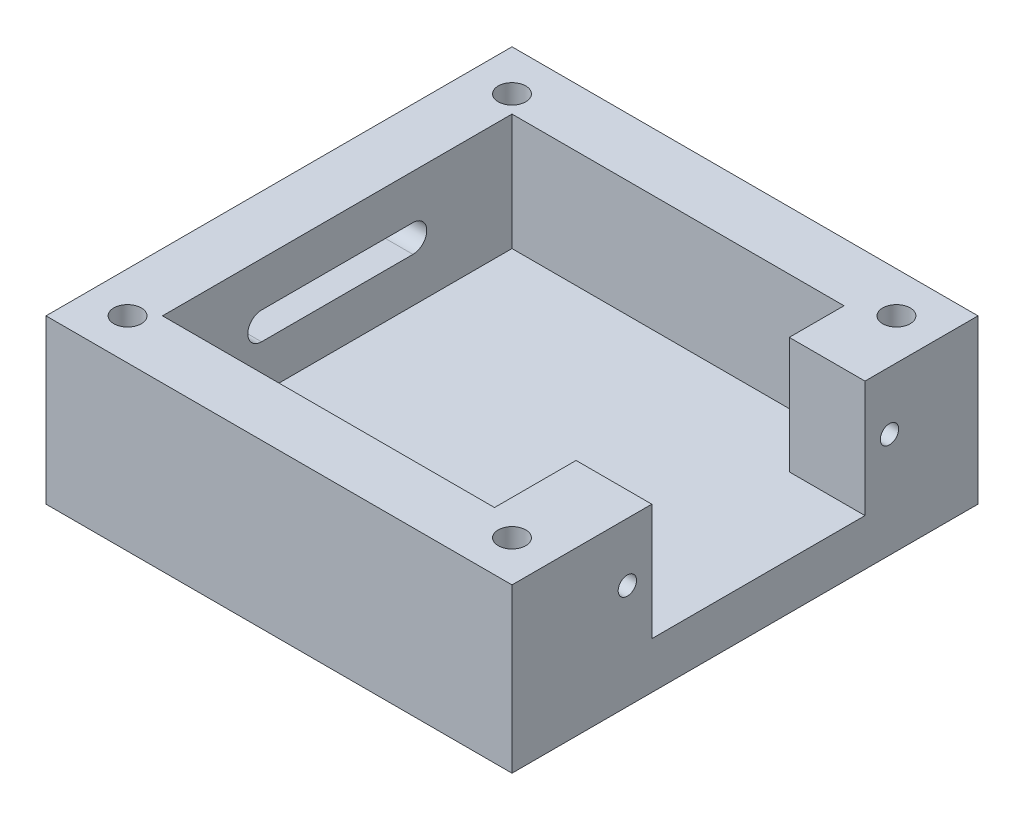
ISO-10303-21;
HEADER;
FILE_DESCRIPTION(('STEP AP214'),'2;1');
FILE_NAME('part.step','',(''),(''),'','','');
FILE_SCHEMA(('AUTOMOTIVE_DESIGN { 1 0 10303 214 1 1 1 1 }'));
ENDSEC;
DATA;
#1=APPLICATION_CONTEXT('core data for automotive mechanical design processes');
#2=APPLICATION_PROTOCOL_DEFINITION('international standard','automotive_design',2000,#1);
#3=PRODUCT_CONTEXT('',#1,'mechanical');
#4=PRODUCT('Part','Part','',(#3));
#5=PRODUCT_RELATED_PRODUCT_CATEGORY('part','',(#4));
#6=PRODUCT_DEFINITION_FORMATION('','',#4);
#7=PRODUCT_DEFINITION_CONTEXT('part definition',#1,'design');
#8=PRODUCT_DEFINITION('design','',#6,#7);
#9=PRODUCT_DEFINITION_SHAPE('','',#8);
#10=(LENGTH_UNIT() NAMED_UNIT(*) SI_UNIT(.MILLI.,.METRE.));
#11=(NAMED_UNIT(*) PLANE_ANGLE_UNIT() SI_UNIT($,.RADIAN.));
#12=(NAMED_UNIT(*) SI_UNIT($,.STERADIAN.) SOLID_ANGLE_UNIT());
#13=UNCERTAINTY_MEASURE_WITH_UNIT(LENGTH_MEASURE(1.E-05),#10,'distance_accuracy_value','');
#14=(GEOMETRIC_REPRESENTATION_CONTEXT(3) GLOBAL_UNCERTAINTY_ASSIGNED_CONTEXT((#13)) GLOBAL_UNIT_ASSIGNED_CONTEXT((#10,
#11,#12)) REPRESENTATION_CONTEXT('',''));
#15=CARTESIAN_POINT('',(0.,0.,0.));
#16=DIRECTION('',(0.,0.,1.));
#17=DIRECTION('',(1.,0.,0.));
#18=AXIS2_PLACEMENT_3D('',#15,#16,#17);
#19=CARTESIAN_POINT('',(0.,5.08,0.));
#20=DIRECTION('',(0.,-1.,0.));
#21=DIRECTION('',(0.,0.,-1.));
#22=AXIS2_PLACEMENT_3D('',#19,#20,#21);
#23=PLANE('',#22);
#24=DIRECTION('',(1.,0.,0.));
#25=VECTOR('',#24,1.);
#26=CARTESIAN_POINT('',(17.145,5.08,-13.081));
#27=LINE('',#26,#25);
#28=CARTESIAN_POINT('',(17.145,5.08,-13.081));
#29=VERTEX_POINT('',#28);
#30=CARTESIAN_POINT('',(25.4,5.08,-13.081));
#31=VERTEX_POINT('',#30);
#32=EDGE_CURVE('E261',#29,#31,#27,.T.);
#33=ORIENTED_EDGE('',*,*,#32,.F.);
#34=DIRECTION('',(0.,0.,1.));
#35=VECTOR('',#34,1.);
#36=CARTESIAN_POINT('',(17.145,5.08,-19.05));
#37=LINE('',#36,#35);
#38=CARTESIAN_POINT('',(17.145,5.08,-19.05));
#39=VERTEX_POINT('',#38);
#40=EDGE_CURVE('E301',#39,#29,#37,.T.);
#41=ORIENTED_EDGE('',*,*,#40,.F.);
#42=DIRECTION('',(1.,0.,0.));
#43=VECTOR('',#42,1.);
#44=CARTESIAN_POINT('',(17.145,5.08,-19.05));
#45=LINE('',#44,#43);
#46=CARTESIAN_POINT('',(-19.05,5.08,-19.05));
#47=VERTEX_POINT('',#46);
#48=EDGE_CURVE('E298',#47,#39,#45,.T.);
#49=ORIENTED_EDGE('',*,*,#48,.F.);
#50=DIRECTION('',(0.,0.,-1.));
#51=VECTOR('',#50,1.);
#52=CARTESIAN_POINT('',(-19.05,5.08,-19.05));
#53=LINE('',#52,#51);
#54=CARTESIAN_POINT('',(-19.05,5.08,19.05));
#55=VERTEX_POINT('',#54);
#56=EDGE_CURVE('E295',#55,#47,#53,.T.);
#57=ORIENTED_EDGE('',*,*,#56,.F.);
#58=DIRECTION('',(-1.,0.,0.));
#59=VECTOR('',#58,1.);
#60=CARTESIAN_POINT('',(-19.05,5.08,19.05));
#61=LINE('',#60,#59);
#62=CARTESIAN_POINT('',(17.145,5.08,19.05));
#63=VERTEX_POINT('',#62);
#64=EDGE_CURVE('E292',#63,#55,#61,.T.);
#65=ORIENTED_EDGE('',*,*,#64,.F.);
#66=DIRECTION('',(0.,0.,1.));
#67=VECTOR('',#66,1.);
#68=CARTESIAN_POINT('',(17.145,5.08,19.05));
#69=LINE('',#68,#67);
#70=CARTESIAN_POINT('',(17.145,5.08,10.16));
#71=VERTEX_POINT('',#70);
#72=EDGE_CURVE('E289',#71,#63,#69,.T.);
#73=ORIENTED_EDGE('',*,*,#72,.F.);
#74=DIRECTION('',(-1.,0.,0.));
#75=VECTOR('',#74,1.);
#76=CARTESIAN_POINT('',(17.145,5.08,10.16));
#77=LINE('',#76,#75);
#78=CARTESIAN_POINT('',(25.4,5.08,10.16));
#79=VERTEX_POINT('',#78);
#80=EDGE_CURVE('E248',#79,#71,#77,.T.);
#81=ORIENTED_EDGE('',*,*,#80,.F.);
#82=DIRECTION('',(0.,0.,-1.));
#83=VECTOR('',#82,1.);
#84=CARTESIAN_POINT('',(25.4,5.08,25.4));
#85=LINE('',#84,#83);
#86=EDGE_CURVE('E330',#79,#31,#85,.T.);
#87=ORIENTED_EDGE('',*,*,#86,.T.);
#88=EDGE_LOOP('',(#33,#41,#49,#57,#65,#73,#81,#87));
#89=FACE_BOUND('',#88,.T.);
#90=ADVANCED_FACE('F41',(#89),#23,.F.);
#91=CARTESIAN_POINT('',(25.4,5.08,25.4));
#92=DIRECTION('',(-1.,0.,0.));
#93=DIRECTION('',(0.,0.,1.));
#94=AXIS2_PLACEMENT_3D('',#91,#92,#93);
#95=PLANE('',#94);
#96=CARTESIAN_POINT('',(25.4,11.43,12.827));
#97=DIRECTION('',(-1.,0.,0.));
#98=DIRECTION('',(0.,0.,1.));
#99=AXIS2_PLACEMENT_3D('',#96,#97,#98);
#100=CIRCLE('',#99,0.999999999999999);
#101=CARTESIAN_POINT('',(25.4,11.43,13.827));
#102=VERTEX_POINT('',#101);
#103=EDGE_CURVE('E245',#102,#102,#100,.T.);
#104=ORIENTED_EDGE('',*,*,#103,.T.);
#105=EDGE_LOOP('',(#104));
#106=FACE_BOUND('',#105,.T.);
#107=CARTESIAN_POINT('',(25.4,11.43,-15.748));
#108=DIRECTION('',(-1.,0.,0.));
#109=DIRECTION('',(0.,0.,1.));
#110=AXIS2_PLACEMENT_3D('',#107,#108,#109);
#111=CIRCLE('',#110,1.);
#112=CARTESIAN_POINT('',(25.4,11.43,-14.748));
#113=VERTEX_POINT('',#112);
#114=EDGE_CURVE('E252',#113,#113,#111,.T.);
#115=ORIENTED_EDGE('',*,*,#114,.T.);
#116=EDGE_LOOP('',(#115));
#117=FACE_BOUND('',#116,.T.);
#118=DIRECTION('',(0.,0.,-1.));
#119=VECTOR('',#118,1.);
#120=CARTESIAN_POINT('',(25.4,0.,25.4));
#121=LINE('',#120,#119);
#122=CARTESIAN_POINT('',(25.4,0.,25.4));
#123=VERTEX_POINT('',#122);
#124=CARTESIAN_POINT('',(25.4,0.,-25.4));
#125=VERTEX_POINT('',#124);
#126=EDGE_CURVE('E329',#123,#125,#121,.T.);
#127=ORIENTED_EDGE('',*,*,#126,.T.);
#128=DIRECTION('',(0.,-1.,0.));
#129=VECTOR('',#128,1.);
#130=CARTESIAN_POINT('',(25.4,5.08,-25.4));
#131=LINE('',#130,#129);
#132=CARTESIAN_POINT('',(25.4,17.78,-25.4));
#133=VERTEX_POINT('',#132);
#134=EDGE_CURVE('E11',#133,#125,#131,.T.);
#135=ORIENTED_EDGE('',*,*,#134,.F.);
#136=DIRECTION('',(0.,0.,-1.));
#137=VECTOR('',#136,1.);
#138=CARTESIAN_POINT('',(25.4,17.78,-13.081));
#139=LINE('',#138,#137);
#140=CARTESIAN_POINT('',(25.4,17.78,-13.081));
#141=VERTEX_POINT('',#140);
#142=EDGE_CURVE('E280',#141,#133,#139,.T.);
#143=ORIENTED_EDGE('',*,*,#142,.F.);
#144=DIRECTION('',(0.,-1.,0.));
#145=VECTOR('',#144,1.);
#146=CARTESIAN_POINT('',(25.4,17.78,-13.081));
#147=LINE('',#146,#145);
#148=EDGE_CURVE('E286',#141,#31,#147,.T.);
#149=ORIENTED_EDGE('',*,*,#148,.T.);
#150=ORIENTED_EDGE('',*,*,#86,.F.);
#151=DIRECTION('',(0.,-1.,0.));
#152=VECTOR('',#151,1.);
#153=CARTESIAN_POINT('',(25.4,17.78,10.16));
#154=LINE('',#153,#152);
#155=CARTESIAN_POINT('',(25.4,17.78,10.16));
#156=VERTEX_POINT('',#155);
#157=EDGE_CURVE('E326',#156,#79,#154,.T.);
#158=ORIENTED_EDGE('',*,*,#157,.F.);
#159=DIRECTION('',(0.,0.,-1.));
#160=VECTOR('',#159,1.);
#161=CARTESIAN_POINT('',(25.4,17.78,25.4));
#162=LINE('',#161,#160);
#163=CARTESIAN_POINT('',(25.4,17.78,25.4));
#164=VERTEX_POINT('',#163);
#165=EDGE_CURVE('E264',#164,#156,#162,.T.);
#166=ORIENTED_EDGE('',*,*,#165,.F.);
#167=DIRECTION('',(0.,-1.,0.));
#168=VECTOR('',#167,1.);
#169=CARTESIAN_POINT('',(25.4,5.08,25.4));
#170=LINE('',#169,#168);
#171=EDGE_CURVE('E332',#164,#123,#170,.T.);
#172=ORIENTED_EDGE('',*,*,#171,.T.);
#173=EDGE_LOOP('',(#127,#135,#143,#149,#150,#158,#166,#172));
#174=FACE_BOUND('',#173,.T.);
#175=ADVANCED_FACE('F43',(#106,#117,#174),#95,.F.);
#176=CARTESIAN_POINT('',(-25.4,5.08,-25.4));
#177=DIRECTION('',(0.,0.,1.));
#178=DIRECTION('',(1.,0.,0.));
#179=AXIS2_PLACEMENT_3D('',#176,#177,#178);
#180=PLANE('',#179);
#181=DIRECTION('',(-1.,0.,0.));
#182=VECTOR('',#181,1.);
#183=CARTESIAN_POINT('',(-25.4,0.,-25.4));
#184=LINE('',#183,#182);
#185=CARTESIAN_POINT('',(-25.4,0.,-25.4));
#186=VERTEX_POINT('',#185);
#187=EDGE_CURVE('E336',#125,#186,#184,.T.);
#188=ORIENTED_EDGE('',*,*,#187,.T.);
#189=DIRECTION('',(0.,-1.,0.));
#190=VECTOR('',#189,1.);
#191=CARTESIAN_POINT('',(-25.4,5.08,-25.4));
#192=LINE('',#191,#190);
#193=CARTESIAN_POINT('',(-25.4,17.78,-25.4));
#194=VERTEX_POINT('',#193);
#195=EDGE_CURVE('E49',#194,#186,#192,.T.);
#196=ORIENTED_EDGE('',*,*,#195,.F.);
#197=DIRECTION('',(-1.,0.,0.));
#198=VECTOR('',#197,1.);
#199=CARTESIAN_POINT('',(25.4,17.78,-25.4));
#200=LINE('',#199,#198);
#201=EDGE_CURVE('E283',#133,#194,#200,.T.);
#202=ORIENTED_EDGE('',*,*,#201,.F.);
#203=ORIENTED_EDGE('',*,*,#134,.T.);
#204=EDGE_LOOP('',(#188,#196,#202,#203));
#205=FACE_BOUND('',#204,.T.);
#206=ADVANCED_FACE('F368',(#205),#180,.F.);
#207=CARTESIAN_POINT('',(-25.4,5.08,25.4));
#208=DIRECTION('',(1.,0.,0.));
#209=DIRECTION('',(0.,0.,-1.));
#210=AXIS2_PLACEMENT_3D('',#207,#208,#209);
#211=PLANE('',#210);
#212=DIRECTION('',(0.,0.,-1.));
#213=VECTOR('',#212,1.);
#214=CARTESIAN_POINT('',(-25.4,12.93,8.255));
#215=LINE('',#214,#213);
#216=CARTESIAN_POINT('',(-25.4,12.93,8.255));
#217=VERTEX_POINT('',#216);
#218=CARTESIAN_POINT('',(-25.4,12.93,-8.255));
#219=VERTEX_POINT('',#218);
#220=EDGE_CURVE('E176',#217,#219,#215,.T.);
#221=ORIENTED_EDGE('',*,*,#220,.F.);
#222=CARTESIAN_POINT('',(-25.4,11.43,8.255));
#223=DIRECTION('',(-1.,0.,0.));
#224=DIRECTION('',(0.,0.,1.));
#225=AXIS2_PLACEMENT_3D('',#222,#223,#224);
#226=CIRCLE('',#225,1.5);
#227=CARTESIAN_POINT('',(-25.4,9.93,8.255));
#228=VERTEX_POINT('',#227);
#229=EDGE_CURVE('E56',#228,#217,#226,.T.);
#230=ORIENTED_EDGE('',*,*,#229,.F.);
#231=DIRECTION('',(0.,0.,1.));
#232=VECTOR('',#231,1.);
#233=CARTESIAN_POINT('',(-25.4,9.93,8.255));
#234=LINE('',#233,#232);
#235=CARTESIAN_POINT('',(-25.4,9.93,-8.255));
#236=VERTEX_POINT('',#235);
#237=EDGE_CURVE('E162',#236,#228,#234,.T.);
#238=ORIENTED_EDGE('',*,*,#237,.F.);
#239=CARTESIAN_POINT('',(-25.4,11.43,-8.255));
#240=DIRECTION('',(-1.,0.,0.));
#241=DIRECTION('',(0.,0.,1.));
#242=AXIS2_PLACEMENT_3D('',#239,#240,#241);
#243=CIRCLE('',#242,1.5);
#244=EDGE_CURVE('E182',#219,#236,#243,.T.);
#245=ORIENTED_EDGE('',*,*,#244,.F.);
#246=EDGE_LOOP('',(#221,#230,#238,#245));
#247=FACE_BOUND('',#246,.T.);
#248=DIRECTION('',(0.,0.,1.));
#249=VECTOR('',#248,1.);
#250=CARTESIAN_POINT('',(-25.4,0.,25.4));
#251=LINE('',#250,#249);
#252=CARTESIAN_POINT('',(-25.4,0.,25.4));
#253=VERTEX_POINT('',#252);
#254=EDGE_CURVE('E338',#186,#253,#251,.T.);
#255=ORIENTED_EDGE('',*,*,#254,.T.);
#256=DIRECTION('',(0.,-1.,0.));
#257=VECTOR('',#256,1.);
#258=CARTESIAN_POINT('',(-25.4,5.08,25.4));
#259=LINE('',#258,#257);
#260=CARTESIAN_POINT('',(-25.4,17.78,25.4));
#261=VERTEX_POINT('',#260);
#262=EDGE_CURVE('E343',#261,#253,#259,.T.);
#263=ORIENTED_EDGE('',*,*,#262,.F.);
#264=DIRECTION('',(0.,0.,1.));
#265=VECTOR('',#264,1.);
#266=CARTESIAN_POINT('',(-25.4,17.78,-25.4));
#267=LINE('',#266,#265);
#268=EDGE_CURVE('E257',#194,#261,#267,.T.);
#269=ORIENTED_EDGE('',*,*,#268,.F.);
#270=ORIENTED_EDGE('',*,*,#195,.T.);
#271=EDGE_LOOP('',(#255,#263,#269,#270));
#272=FACE_BOUND('',#271,.T.);
#273=ADVANCED_FACE('F349',(#247,#272),#211,.F.);
#274=CARTESIAN_POINT('',(-25.4,5.08,25.4));
#275=DIRECTION('',(0.,0.,-1.));
#276=DIRECTION('',(-1.,0.,0.));
#277=AXIS2_PLACEMENT_3D('',#274,#275,#276);
#278=PLANE('',#277);
#279=DIRECTION('',(1.,0.,0.));
#280=VECTOR('',#279,1.);
#281=CARTESIAN_POINT('',(-25.4,0.,25.4));
#282=LINE('',#281,#280);
#283=EDGE_CURVE('E333',#253,#123,#282,.T.);
#284=ORIENTED_EDGE('',*,*,#283,.T.);
#285=ORIENTED_EDGE('',*,*,#171,.F.);
#286=DIRECTION('',(1.,0.,0.));
#287=VECTOR('',#286,1.);
#288=CARTESIAN_POINT('',(-25.4,17.78,25.4));
#289=LINE('',#288,#287);
#290=EDGE_CURVE('E260',#261,#164,#289,.T.);
#291=ORIENTED_EDGE('',*,*,#290,.F.);
#292=ORIENTED_EDGE('',*,*,#262,.T.);
#293=EDGE_LOOP('',(#284,#285,#291,#292));
#294=FACE_BOUND('',#293,.T.);
#295=ADVANCED_FACE('F357',(#294),#278,.F.);
#296=CARTESIAN_POINT('',(0.,0.,0.));
#297=DIRECTION('',(0.,-1.,0.));
#298=DIRECTION('',(0.,0.,-1.));
#299=AXIS2_PLACEMENT_3D('',#296,#297,#298);
#300=PLANE('',#299);
#301=CARTESIAN_POINT('',(0.,0.,0.));
#302=DIRECTION('',(0.,-1.,0.));
#303=DIRECTION('',(0.,0.,-1.));
#304=AXIS2_PLACEMENT_3D('',#301,#302,#303);
#305=CIRCLE('',#304,4.064);
#306=CARTESIAN_POINT('',(0.,0.,-4.064));
#307=VERTEX_POINT('',#306);
#308=EDGE_CURVE('E168',#307,#307,#305,.T.);
#309=ORIENTED_EDGE('',*,*,#308,.F.);
#310=EDGE_LOOP('',(#309));
#311=FACE_BOUND('',#310,.T.);
#312=CARTESIAN_POINT('',(20.955,0.,20.955));
#313=DIRECTION('',(0.,-1.,0.));
#314=DIRECTION('',(0.,0.,-1.));
#315=AXIS2_PLACEMENT_3D('',#312,#313,#314);
#316=CIRCLE('',#315,2.921);
#317=CARTESIAN_POINT('',(20.955,0.,18.034));
#318=VERTEX_POINT('',#317);
#319=EDGE_CURVE('E218',#318,#318,#316,.T.);
#320=ORIENTED_EDGE('',*,*,#319,.F.);
#321=EDGE_LOOP('',(#320));
#322=FACE_BOUND('',#321,.T.);
#323=CARTESIAN_POINT('',(20.955,0.,-20.955));
#324=DIRECTION('',(0.,-1.,0.));
#325=DIRECTION('',(0.,0.,-1.));
#326=AXIS2_PLACEMENT_3D('',#323,#324,#325);
#327=CIRCLE('',#326,2.921);
#328=CARTESIAN_POINT('',(20.955,0.,-23.876));
#329=VERTEX_POINT('',#328);
#330=EDGE_CURVE('E231',#329,#329,#327,.T.);
#331=ORIENTED_EDGE('',*,*,#330,.F.);
#332=EDGE_LOOP('',(#331));
#333=FACE_BOUND('',#332,.T.);
#334=CARTESIAN_POINT('',(-20.955,0.,-20.955));
#335=DIRECTION('',(0.,-1.,0.));
#336=DIRECTION('',(0.,0.,-1.));
#337=AXIS2_PLACEMENT_3D('',#334,#335,#336);
#338=CIRCLE('',#337,2.921);
#339=CARTESIAN_POINT('',(-20.955,0.,-23.876));
#340=VERTEX_POINT('',#339);
#341=EDGE_CURVE('E225',#340,#340,#338,.T.);
#342=ORIENTED_EDGE('',*,*,#341,.F.);
#343=EDGE_LOOP('',(#342));
#344=FACE_BOUND('',#343,.T.);
#345=CARTESIAN_POINT('',(-20.955,0.,20.955));
#346=DIRECTION('',(0.,-1.,0.));
#347=DIRECTION('',(0.,0.,-1.));
#348=AXIS2_PLACEMENT_3D('',#345,#346,#347);
#349=CIRCLE('',#348,2.921);
#350=CARTESIAN_POINT('',(-20.955,0.,18.034));
#351=VERTEX_POINT('',#350);
#352=EDGE_CURVE('E224',#351,#351,#349,.T.);
#353=ORIENTED_EDGE('',*,*,#352,.F.);
#354=EDGE_LOOP('',(#353));
#355=FACE_BOUND('',#354,.T.);
#356=ORIENTED_EDGE('',*,*,#126,.F.);
#357=ORIENTED_EDGE('',*,*,#283,.F.);
#358=ORIENTED_EDGE('',*,*,#254,.F.);
#359=ORIENTED_EDGE('',*,*,#187,.F.);
#360=EDGE_LOOP('',(#356,#357,#358,#359));
#361=FACE_BOUND('',#360,.T.);
#362=ADVANCED_FACE('F355',(#311,#322,#333,#344,#355,#361),#300,.T.);
#363=CARTESIAN_POINT('',(17.145,17.78,10.16));
#364=DIRECTION('',(0.,0.,1.));
#365=DIRECTION('',(1.,0.,0.));
#366=AXIS2_PLACEMENT_3D('',#363,#364,#365);
#367=PLANE('',#366);
#368=ORIENTED_EDGE('',*,*,#80,.T.);
#369=DIRECTION('',(0.,-1.,0.));
#370=VECTOR('',#369,1.);
#371=CARTESIAN_POINT('',(17.145,17.78,10.16));
#372=LINE('',#371,#370);
#373=CARTESIAN_POINT('',(17.145,17.78,10.16));
#374=VERTEX_POINT('',#373);
#375=EDGE_CURVE('E323',#374,#71,#372,.T.);
#376=ORIENTED_EDGE('',*,*,#375,.F.);
#377=DIRECTION('',(-1.,0.,0.));
#378=VECTOR('',#377,1.);
#379=CARTESIAN_POINT('',(17.145,17.78,10.16));
#380=LINE('',#379,#378);
#381=EDGE_CURVE('E266',#156,#374,#380,.T.);
#382=ORIENTED_EDGE('',*,*,#381,.F.);
#383=ORIENTED_EDGE('',*,*,#157,.T.);
#384=EDGE_LOOP('',(#368,#376,#382,#383));
#385=FACE_BOUND('',#384,.T.);
#386=ADVANCED_FACE('F393',(#385),#367,.F.);
#387=CARTESIAN_POINT('',(17.145,17.78,19.05));
#388=DIRECTION('',(1.,0.,0.));
#389=DIRECTION('',(0.,0.,-1.));
#390=AXIS2_PLACEMENT_3D('',#387,#388,#389);
#391=PLANE('',#390);
#392=CARTESIAN_POINT('',(17.145,11.43,12.827));
#393=DIRECTION('',(-1.,0.,0.));
#394=DIRECTION('',(0.,0.,1.));
#395=AXIS2_PLACEMENT_3D('',#392,#393,#394);
#396=CIRCLE('',#395,0.999999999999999);
#397=CARTESIAN_POINT('',(17.145,11.43,13.827));
#398=VERTEX_POINT('',#397);
#399=EDGE_CURVE('E249',#398,#398,#396,.T.);
#400=ORIENTED_EDGE('',*,*,#399,.F.);
#401=EDGE_LOOP('',(#400));
#402=FACE_BOUND('',#401,.T.);
#403=ORIENTED_EDGE('',*,*,#72,.T.);
#404=DIRECTION('',(0.,-1.,0.));
#405=VECTOR('',#404,1.);
#406=CARTESIAN_POINT('',(17.145,17.78,19.05));
#407=LINE('',#406,#405);
#408=CARTESIAN_POINT('',(17.145,17.78,19.05));
#409=VERTEX_POINT('',#408);
#410=EDGE_CURVE('E320',#409,#63,#407,.T.);
#411=ORIENTED_EDGE('',*,*,#410,.F.);
#412=DIRECTION('',(0.,0.,1.));
#413=VECTOR('',#412,1.);
#414=CARTESIAN_POINT('',(17.145,17.78,19.05));
#415=LINE('',#414,#413);
#416=EDGE_CURVE('E268',#374,#409,#415,.T.);
#417=ORIENTED_EDGE('',*,*,#416,.F.);
#418=ORIENTED_EDGE('',*,*,#375,.T.);
#419=EDGE_LOOP('',(#403,#411,#417,#418));
#420=FACE_BOUND('',#419,.T.);
#421=ADVANCED_FACE('F390',(#402,#420),#391,.F.);
#422=CARTESIAN_POINT('',(-19.05,17.78,19.05));
#423=DIRECTION('',(0.,0.,1.));
#424=DIRECTION('',(1.,0.,0.));
#425=AXIS2_PLACEMENT_3D('',#422,#423,#424);
#426=PLANE('',#425);
#427=ORIENTED_EDGE('',*,*,#64,.T.);
#428=DIRECTION('',(0.,-1.,0.));
#429=VECTOR('',#428,1.);
#430=CARTESIAN_POINT('',(-19.05,17.78,19.05));
#431=LINE('',#430,#429);
#432=CARTESIAN_POINT('',(-19.05,17.78,19.05));
#433=VERTEX_POINT('',#432);
#434=EDGE_CURVE('E317',#433,#55,#431,.T.);
#435=ORIENTED_EDGE('',*,*,#434,.F.);
#436=DIRECTION('',(-1.,0.,0.));
#437=VECTOR('',#436,1.);
#438=CARTESIAN_POINT('',(-19.05,17.78,19.05));
#439=LINE('',#438,#437);
#440=EDGE_CURVE('E270',#409,#433,#439,.T.);
#441=ORIENTED_EDGE('',*,*,#440,.F.);
#442=ORIENTED_EDGE('',*,*,#410,.T.);
#443=EDGE_LOOP('',(#427,#435,#441,#442));
#444=FACE_BOUND('',#443,.T.);
#445=ADVANCED_FACE('F387',(#444),#426,.F.);
#446=CARTESIAN_POINT('',(-19.05,17.78,-19.05));
#447=DIRECTION('',(-1.,0.,0.));
#448=DIRECTION('',(0.,0.,1.));
#449=AXIS2_PLACEMENT_3D('',#446,#447,#448);
#450=PLANE('',#449);
#451=DIRECTION('',(0.,0.,-1.));
#452=VECTOR('',#451,1.);
#453=CARTESIAN_POINT('',(-19.05,9.93,8.255));
#454=LINE('',#453,#452);
#455=CARTESIAN_POINT('',(-19.05,9.93,8.255));
#456=VERTEX_POINT('',#455);
#457=CARTESIAN_POINT('',(-19.05,9.93,-8.255));
#458=VERTEX_POINT('',#457);
#459=EDGE_CURVE('E174',#456,#458,#454,.T.);
#460=ORIENTED_EDGE('',*,*,#459,.F.);
#461=CARTESIAN_POINT('',(-19.05,11.43,8.255));
#462=DIRECTION('',(-1.,0.,0.));
#463=DIRECTION('',(0.,0.,1.));
#464=AXIS2_PLACEMENT_3D('',#461,#462,#463);
#465=CIRCLE('',#464,1.5);
#466=CARTESIAN_POINT('',(-19.05,12.93,8.255));
#467=VERTEX_POINT('',#466);
#468=EDGE_CURVE('E156',#467,#456,#465,.F.);
#469=ORIENTED_EDGE('',*,*,#468,.F.);
#470=DIRECTION('',(0.,0.,1.));
#471=VECTOR('',#470,1.);
#472=CARTESIAN_POINT('',(-19.05,12.93,8.255));
#473=LINE('',#472,#471);
#474=CARTESIAN_POINT('',(-19.05,12.93,-8.255));
#475=VERTEX_POINT('',#474);
#476=EDGE_CURVE('E165',#475,#467,#473,.T.);
#477=ORIENTED_EDGE('',*,*,#476,.F.);
#478=CARTESIAN_POINT('',(-19.05,11.43,-8.255));
#479=DIRECTION('',(-1.,0.,0.));
#480=DIRECTION('',(0.,0.,1.));
#481=AXIS2_PLACEMENT_3D('',#478,#479,#480);
#482=CIRCLE('',#481,1.5);
#483=EDGE_CURVE('E64',#458,#475,#482,.F.);
#484=ORIENTED_EDGE('',*,*,#483,.F.);
#485=EDGE_LOOP('',(#460,#469,#477,#484));
#486=FACE_BOUND('',#485,.T.);
#487=ORIENTED_EDGE('',*,*,#56,.T.);
#488=DIRECTION('',(0.,-1.,0.));
#489=VECTOR('',#488,1.);
#490=CARTESIAN_POINT('',(-19.05,17.78,-19.05));
#491=LINE('',#490,#489);
#492=CARTESIAN_POINT('',(-19.05,17.78,-19.05));
#493=VERTEX_POINT('',#492);
#494=EDGE_CURVE('E314',#493,#47,#491,.T.);
#495=ORIENTED_EDGE('',*,*,#494,.F.);
#496=DIRECTION('',(0.,0.,-1.));
#497=VECTOR('',#496,1.);
#498=CARTESIAN_POINT('',(-19.05,17.78,-19.05));
#499=LINE('',#498,#497);
#500=EDGE_CURVE('E272',#433,#493,#499,.T.);
#501=ORIENTED_EDGE('',*,*,#500,.F.);
#502=ORIENTED_EDGE('',*,*,#434,.T.);
#503=EDGE_LOOP('',(#487,#495,#501,#502));
#504=FACE_BOUND('',#503,.T.);
#505=ADVANCED_FACE('F171',(#486,#504),#450,.F.);
#506=CARTESIAN_POINT('',(17.145,17.78,-19.05));
#507=DIRECTION('',(0.,0.,-1.));
#508=DIRECTION('',(-1.,0.,0.));
#509=AXIS2_PLACEMENT_3D('',#506,#507,#508);
#510=PLANE('',#509);
#511=ORIENTED_EDGE('',*,*,#48,.T.);
#512=DIRECTION('',(0.,-1.,0.));
#513=VECTOR('',#512,1.);
#514=CARTESIAN_POINT('',(17.145,17.78,-19.05));
#515=LINE('',#514,#513);
#516=CARTESIAN_POINT('',(17.145,17.78,-19.05));
#517=VERTEX_POINT('',#516);
#518=EDGE_CURVE('E311',#517,#39,#515,.T.);
#519=ORIENTED_EDGE('',*,*,#518,.F.);
#520=DIRECTION('',(1.,0.,0.));
#521=VECTOR('',#520,1.);
#522=CARTESIAN_POINT('',(17.145,17.78,-19.05));
#523=LINE('',#522,#521);
#524=EDGE_CURVE('E274',#493,#517,#523,.T.);
#525=ORIENTED_EDGE('',*,*,#524,.F.);
#526=ORIENTED_EDGE('',*,*,#494,.T.);
#527=EDGE_LOOP('',(#511,#519,#525,#526));
#528=FACE_BOUND('',#527,.T.);
#529=ADVANCED_FACE('F381',(#528),#510,.F.);
#530=CARTESIAN_POINT('',(17.145,17.78,-19.05));
#531=DIRECTION('',(1.,0.,0.));
#532=DIRECTION('',(0.,0.,-1.));
#533=AXIS2_PLACEMENT_3D('',#530,#531,#532);
#534=PLANE('',#533);
#535=CARTESIAN_POINT('',(17.145,11.43,-15.748));
#536=DIRECTION('',(-1.,0.,0.));
#537=DIRECTION('',(0.,0.,1.));
#538=AXIS2_PLACEMENT_3D('',#535,#536,#537);
#539=CIRCLE('',#538,1.);
#540=CARTESIAN_POINT('',(17.145,11.43,-14.748));
#541=VERTEX_POINT('',#540);
#542=EDGE_CURVE('E242',#541,#541,#539,.T.);
#543=ORIENTED_EDGE('',*,*,#542,.F.);
#544=EDGE_LOOP('',(#543));
#545=FACE_BOUND('',#544,.T.);
#546=ORIENTED_EDGE('',*,*,#40,.T.);
#547=DIRECTION('',(0.,-1.,0.));
#548=VECTOR('',#547,1.);
#549=CARTESIAN_POINT('',(17.145,17.78,-13.081));
#550=LINE('',#549,#548);
#551=CARTESIAN_POINT('',(17.145,17.78,-13.081));
#552=VERTEX_POINT('',#551);
#553=EDGE_CURVE('E308',#552,#29,#550,.T.);
#554=ORIENTED_EDGE('',*,*,#553,.F.);
#555=DIRECTION('',(0.,0.,1.));
#556=VECTOR('',#555,1.);
#557=CARTESIAN_POINT('',(17.145,17.78,-19.05));
#558=LINE('',#557,#556);
#559=EDGE_CURVE('E276',#517,#552,#558,.T.);
#560=ORIENTED_EDGE('',*,*,#559,.F.);
#561=ORIENTED_EDGE('',*,*,#518,.T.);
#562=EDGE_LOOP('',(#546,#554,#560,#561));
#563=FACE_BOUND('',#562,.T.);
#564=ADVANCED_FACE('F376',(#545,#563),#534,.F.);
#565=CARTESIAN_POINT('',(17.145,17.78,-13.081));
#566=DIRECTION('',(0.,0.,-1.));
#567=DIRECTION('',(-1.,0.,0.));
#568=AXIS2_PLACEMENT_3D('',#565,#566,#567);
#569=PLANE('',#568);
#570=ORIENTED_EDGE('',*,*,#32,.T.);
#571=ORIENTED_EDGE('',*,*,#148,.F.);
#572=DIRECTION('',(1.,0.,0.));
#573=VECTOR('',#572,1.);
#574=CARTESIAN_POINT('',(17.145,17.78,-13.081));
#575=LINE('',#574,#573);
#576=EDGE_CURVE('E278',#552,#141,#575,.T.);
#577=ORIENTED_EDGE('',*,*,#576,.F.);
#578=ORIENTED_EDGE('',*,*,#553,.T.);
#579=EDGE_LOOP('',(#570,#571,#577,#578));
#580=FACE_BOUND('',#579,.T.);
#581=ADVANCED_FACE('F372',(#580),#569,.F.);
#582=CARTESIAN_POINT('',(0.,17.78,0.));
#583=DIRECTION('',(0.,1.,0.));
#584=DIRECTION('',(0.,0.,1.));
#585=AXIS2_PLACEMENT_3D('',#582,#583,#584);
#586=PLANE('',#585);
#587=CARTESIAN_POINT('',(-20.955,17.78,-20.955));
#588=DIRECTION('',(0.,-1.,0.));
#589=DIRECTION('',(0.,0.,-1.));
#590=AXIS2_PLACEMENT_3D('',#587,#588,#589);
#591=CIRCLE('',#590,1.49987);
#592=CARTESIAN_POINT('',(-20.955,17.78,-22.45487));
#593=VERTEX_POINT('',#592);
#594=EDGE_CURVE('E210',#593,#593,#591,.T.);
#595=ORIENTED_EDGE('',*,*,#594,.T.);
#596=EDGE_LOOP('',(#595));
#597=FACE_BOUND('',#596,.T.);
#598=CARTESIAN_POINT('',(20.955,17.78,-20.955));
#599=DIRECTION('',(0.,-1.,0.));
#600=DIRECTION('',(0.,0.,-1.));
#601=AXIS2_PLACEMENT_3D('',#598,#599,#600);
#602=CIRCLE('',#601,1.49987);
#603=CARTESIAN_POINT('',(20.955,17.78,-22.45487));
#604=VERTEX_POINT('',#603);
#605=EDGE_CURVE('E204',#604,#604,#602,.T.);
#606=ORIENTED_EDGE('',*,*,#605,.T.);
#607=EDGE_LOOP('',(#606));
#608=FACE_BOUND('',#607,.T.);
#609=CARTESIAN_POINT('',(20.955,17.78,20.955));
#610=DIRECTION('',(0.,-1.,0.));
#611=DIRECTION('',(0.,0.,-1.));
#612=AXIS2_PLACEMENT_3D('',#609,#610,#611);
#613=CIRCLE('',#612,1.49987);
#614=CARTESIAN_POINT('',(20.955,17.78,19.45513));
#615=VERTEX_POINT('',#614);
#616=EDGE_CURVE('E197',#615,#615,#613,.T.);
#617=ORIENTED_EDGE('',*,*,#616,.T.);
#618=EDGE_LOOP('',(#617));
#619=FACE_BOUND('',#618,.T.);
#620=CARTESIAN_POINT('',(-20.955,17.78,20.955));
#621=DIRECTION('',(0.,-1.,0.));
#622=DIRECTION('',(0.,0.,-1.));
#623=AXIS2_PLACEMENT_3D('',#620,#621,#622);
#624=CIRCLE('',#623,1.49987);
#625=CARTESIAN_POINT('',(-20.955,17.78,19.45513));
#626=VERTEX_POINT('',#625);
#627=EDGE_CURVE('E215',#626,#626,#624,.T.);
#628=ORIENTED_EDGE('',*,*,#627,.T.);
#629=EDGE_LOOP('',(#628));
#630=FACE_BOUND('',#629,.T.);
#631=ORIENTED_EDGE('',*,*,#268,.T.);
#632=ORIENTED_EDGE('',*,*,#290,.T.);
#633=ORIENTED_EDGE('',*,*,#165,.T.);
#634=ORIENTED_EDGE('',*,*,#381,.T.);
#635=ORIENTED_EDGE('',*,*,#416,.T.);
#636=ORIENTED_EDGE('',*,*,#440,.T.);
#637=ORIENTED_EDGE('',*,*,#500,.T.);
#638=ORIENTED_EDGE('',*,*,#524,.T.);
#639=ORIENTED_EDGE('',*,*,#559,.T.);
#640=ORIENTED_EDGE('',*,*,#576,.T.);
#641=ORIENTED_EDGE('',*,*,#142,.T.);
#642=ORIENTED_EDGE('',*,*,#201,.T.);
#643=EDGE_LOOP('',(#631,#632,#633,#634,#635,#636,#637,#638,#639,#640,#641,#642));
#644=FACE_BOUND('',#643,.T.);
#645=ADVANCED_FACE('F365',(#597,#608,#619,#630,#644),#586,.T.);
#646=CARTESIAN_POINT('',(25.4,11.43,-15.748));
#647=DIRECTION('',(-1.,0.,0.));
#648=DIRECTION('',(0.,0.,1.));
#649=AXIS2_PLACEMENT_3D('',#646,#647,#648);
#650=CYLINDRICAL_SURFACE('',#649,1.);
#651=ORIENTED_EDGE('',*,*,#114,.F.);
#652=EDGE_LOOP('',(#651));
#653=FACE_BOUND('',#652,.T.);
#654=ORIENTED_EDGE('',*,*,#542,.T.);
#655=EDGE_LOOP('',(#654));
#656=FACE_BOUND('',#655,.T.);
#657=ADVANCED_FACE('F553',(#653,#656),#650,.F.);
#658=CARTESIAN_POINT('',(25.4,11.43,12.827));
#659=DIRECTION('',(-1.,0.,0.));
#660=DIRECTION('',(0.,0.,1.));
#661=AXIS2_PLACEMENT_3D('',#658,#659,#660);
#662=CYLINDRICAL_SURFACE('',#661,0.999999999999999);
#663=ORIENTED_EDGE('',*,*,#103,.F.);
#664=EDGE_LOOP('',(#663));
#665=FACE_BOUND('',#664,.T.);
#666=ORIENTED_EDGE('',*,*,#399,.T.);
#667=EDGE_LOOP('',(#666));
#668=FACE_BOUND('',#667,.T.);
#669=ADVANCED_FACE('F549',(#665,#668),#662,.F.);
#670=CARTESIAN_POINT('',(-20.955,4.445,20.955));
#671=DIRECTION('',(0.,-1.,0.));
#672=DIRECTION('',(0.,0.,-1.));
#673=AXIS2_PLACEMENT_3D('',#670,#671,#672);
#674=CYLINDRICAL_SURFACE('',#673,2.921);
#675=CARTESIAN_POINT('',(-20.955,4.445,20.955));
#676=DIRECTION('',(0.,-1.,0.));
#677=DIRECTION('',(0.,0.,-1.));
#678=AXIS2_PLACEMENT_3D('',#675,#676,#677);
#679=CIRCLE('',#678,2.921);
#680=CARTESIAN_POINT('',(-20.955,4.445,18.034));
#681=VERTEX_POINT('',#680);
#682=EDGE_CURVE('E239',#681,#681,#679,.T.);
#683=ORIENTED_EDGE('',*,*,#682,.F.);
#684=EDGE_LOOP('',(#683));
#685=FACE_BOUND('',#684,.T.);
#686=ORIENTED_EDGE('',*,*,#352,.T.);
#687=EDGE_LOOP('',(#686));
#688=FACE_BOUND('',#687,.T.);
#689=ADVANCED_FACE('F545',(#685,#688),#674,.F.);
#690=CARTESIAN_POINT('',(-20.955,4.445,20.955));
#691=DIRECTION('',(0.,-1.,0.));
#692=DIRECTION('',(0.,0.,-1.));
#693=AXIS2_PLACEMENT_3D('',#690,#691,#692);
#694=PLANE('',#693);
#695=CARTESIAN_POINT('',(-20.955,4.445,20.955));
#696=DIRECTION('',(0.,-1.,0.));
#697=DIRECTION('',(0.,0.,-1.));
#698=AXIS2_PLACEMENT_3D('',#695,#696,#697);
#699=CIRCLE('',#698,1.49987);
#700=CARTESIAN_POINT('',(-20.955,4.445,19.45513));
#701=VERTEX_POINT('',#700);
#702=EDGE_CURVE('E200',#701,#701,#699,.T.);
#703=ORIENTED_EDGE('',*,*,#702,.F.);
#704=EDGE_LOOP('',(#703));
#705=FACE_BOUND('',#704,.T.);
#706=ORIENTED_EDGE('',*,*,#682,.T.);
#707=EDGE_LOOP('',(#706));
#708=FACE_BOUND('',#707,.T.);
#709=ADVANCED_FACE('F527',(#705,#708),#694,.T.);
#710=CARTESIAN_POINT('',(-20.955,4.445,-20.955));
#711=DIRECTION('',(0.,-1.,0.));
#712=DIRECTION('',(0.,0.,-1.));
#713=AXIS2_PLACEMENT_3D('',#710,#711,#712);
#714=CYLINDRICAL_SURFACE('',#713,2.921);
#715=CARTESIAN_POINT('',(-20.955,4.445,-20.955));
#716=DIRECTION('',(0.,-1.,0.));
#717=DIRECTION('',(0.,0.,-1.));
#718=AXIS2_PLACEMENT_3D('',#715,#716,#717);
#719=CIRCLE('',#718,2.921);
#720=CARTESIAN_POINT('',(-20.955,4.445,-23.876));
#721=VERTEX_POINT('',#720);
#722=EDGE_CURVE('E221',#721,#721,#719,.T.);
#723=ORIENTED_EDGE('',*,*,#722,.F.);
#724=EDGE_LOOP('',(#723));
#725=FACE_BOUND('',#724,.T.);
#726=ORIENTED_EDGE('',*,*,#341,.T.);
#727=EDGE_LOOP('',(#726));
#728=FACE_BOUND('',#727,.T.);
#729=ADVANCED_FACE('F523',(#725,#728),#714,.F.);
#730=CARTESIAN_POINT('',(-20.955,4.445,-20.955));
#731=DIRECTION('',(0.,-1.,0.));
#732=DIRECTION('',(0.,0.,-1.));
#733=AXIS2_PLACEMENT_3D('',#730,#731,#732);
#734=PLANE('',#733);
#735=CARTESIAN_POINT('',(-20.955,4.445,-20.955));
#736=DIRECTION('',(0.,-1.,0.));
#737=DIRECTION('',(0.,0.,-1.));
#738=AXIS2_PLACEMENT_3D('',#735,#736,#737);
#739=CIRCLE('',#738,1.49987);
#740=CARTESIAN_POINT('',(-20.955,4.445,-22.45487));
#741=VERTEX_POINT('',#740);
#742=EDGE_CURVE('E194',#741,#741,#739,.T.);
#743=ORIENTED_EDGE('',*,*,#742,.F.);
#744=EDGE_LOOP('',(#743));
#745=FACE_BOUND('',#744,.T.);
#746=ORIENTED_EDGE('',*,*,#722,.T.);
#747=EDGE_LOOP('',(#746));
#748=FACE_BOUND('',#747,.T.);
#749=ADVANCED_FACE('F519',(#745,#748),#734,.T.);
#750=CARTESIAN_POINT('',(20.955,4.445,-20.955));
#751=DIRECTION('',(0.,-1.,0.));
#752=DIRECTION('',(0.,0.,-1.));
#753=AXIS2_PLACEMENT_3D('',#750,#751,#752);
#754=CYLINDRICAL_SURFACE('',#753,2.921);
#755=CARTESIAN_POINT('',(20.955,4.445,-20.955));
#756=DIRECTION('',(0.,-1.,0.));
#757=DIRECTION('',(0.,0.,-1.));
#758=AXIS2_PLACEMENT_3D('',#755,#756,#757);
#759=CIRCLE('',#758,2.921);
#760=CARTESIAN_POINT('',(20.955,4.445,-23.876));
#761=VERTEX_POINT('',#760);
#762=EDGE_CURVE('E228',#761,#761,#759,.T.);
#763=ORIENTED_EDGE('',*,*,#762,.F.);
#764=EDGE_LOOP('',(#763));
#765=FACE_BOUND('',#764,.T.);
#766=ORIENTED_EDGE('',*,*,#330,.T.);
#767=EDGE_LOOP('',(#766));
#768=FACE_BOUND('',#767,.T.);
#769=ADVANCED_FACE('F522',(#765,#768),#754,.F.);
#770=CARTESIAN_POINT('',(20.955,4.445,-20.955));
#771=DIRECTION('',(0.,-1.,0.));
#772=DIRECTION('',(0.,0.,-1.));
#773=AXIS2_PLACEMENT_3D('',#770,#771,#772);
#774=PLANE('',#773);
#775=CARTESIAN_POINT('',(20.955,4.445,-20.955));
#776=DIRECTION('',(0.,-1.,0.));
#777=DIRECTION('',(0.,0.,-1.));
#778=AXIS2_PLACEMENT_3D('',#775,#776,#777);
#779=CIRCLE('',#778,1.49987);
#780=CARTESIAN_POINT('',(20.955,4.445,-22.45487));
#781=VERTEX_POINT('',#780);
#782=EDGE_CURVE('E207',#781,#781,#779,.T.);
#783=ORIENTED_EDGE('',*,*,#782,.F.);
#784=EDGE_LOOP('',(#783));
#785=FACE_BOUND('',#784,.T.);
#786=ORIENTED_EDGE('',*,*,#762,.T.);
#787=EDGE_LOOP('',(#786));
#788=FACE_BOUND('',#787,.T.);
#789=ADVANCED_FACE('F529',(#785,#788),#774,.T.);
#790=CARTESIAN_POINT('',(20.955,4.445,20.955));
#791=DIRECTION('',(0.,-1.,0.));
#792=DIRECTION('',(0.,0.,-1.));
#793=AXIS2_PLACEMENT_3D('',#790,#791,#792);
#794=CYLINDRICAL_SURFACE('',#793,2.921);
#795=CARTESIAN_POINT('',(20.955,4.445,20.955));
#796=DIRECTION('',(0.,-1.,0.));
#797=DIRECTION('',(0.,0.,-1.));
#798=AXIS2_PLACEMENT_3D('',#795,#796,#797);
#799=CIRCLE('',#798,2.921);
#800=CARTESIAN_POINT('',(20.955,4.445,18.034));
#801=VERTEX_POINT('',#800);
#802=EDGE_CURVE('E234',#801,#801,#799,.T.);
#803=ORIENTED_EDGE('',*,*,#802,.F.);
#804=EDGE_LOOP('',(#803));
#805=FACE_BOUND('',#804,.T.);
#806=ORIENTED_EDGE('',*,*,#319,.T.);
#807=EDGE_LOOP('',(#806));
#808=FACE_BOUND('',#807,.T.);
#809=ADVANCED_FACE('F532',(#805,#808),#794,.F.);
#810=CARTESIAN_POINT('',(20.955,4.445,20.955));
#811=DIRECTION('',(0.,-1.,0.));
#812=DIRECTION('',(0.,0.,-1.));
#813=AXIS2_PLACEMENT_3D('',#810,#811,#812);
#814=PLANE('',#813);
#815=CARTESIAN_POINT('',(20.955,4.445,20.955));
#816=DIRECTION('',(0.,-1.,0.));
#817=DIRECTION('',(0.,0.,-1.));
#818=AXIS2_PLACEMENT_3D('',#815,#816,#817);
#819=CIRCLE('',#818,1.49987);
#820=CARTESIAN_POINT('',(20.955,4.445,19.45513));
#821=VERTEX_POINT('',#820);
#822=EDGE_CURVE('E201',#821,#821,#819,.T.);
#823=ORIENTED_EDGE('',*,*,#822,.F.);
#824=EDGE_LOOP('',(#823));
#825=FACE_BOUND('',#824,.T.);
#826=ORIENTED_EDGE('',*,*,#802,.T.);
#827=EDGE_LOOP('',(#826));
#828=FACE_BOUND('',#827,.T.);
#829=ADVANCED_FACE('F517',(#825,#828),#814,.T.);
#830=CARTESIAN_POINT('',(-20.955,17.78,20.955));
#831=DIRECTION('',(0.,-1.,0.));
#832=DIRECTION('',(0.,0.,-1.));
#833=AXIS2_PLACEMENT_3D('',#830,#831,#832);
#834=CYLINDRICAL_SURFACE('',#833,1.49987);
#835=CARTESIAN_POINT('',(-20.955,17.78,19.45513));
#836=CARTESIAN_POINT('',(-20.955,17.64109375,19.45513));
#837=CARTESIAN_POINT('',(-20.955,17.5021875,19.45513));
#838=CARTESIAN_POINT('',(-20.955,17.224375,19.45513));
#839=CARTESIAN_POINT('',(-20.955,17.08546875,19.45513));
#840=CARTESIAN_POINT('',(-20.955,16.80765625,19.45513));
#841=CARTESIAN_POINT('',(-20.955,16.66875,19.45513));
#842=CARTESIAN_POINT('',(-20.955,16.3909375,19.45513));
#843=CARTESIAN_POINT('',(-20.955,16.25203125,19.45513));
#844=CARTESIAN_POINT('',(-20.955,15.97421875,19.45513));
#845=CARTESIAN_POINT('',(-20.955,15.8353125,19.45513));
#846=CARTESIAN_POINT('',(-20.955,15.5575,19.45513));
#847=CARTESIAN_POINT('',(-20.955,15.41859375,19.45513));
#848=CARTESIAN_POINT('',(-20.955,15.14078125,19.45513));
#849=CARTESIAN_POINT('',(-20.955,15.001875,19.45513));
#850=CARTESIAN_POINT('',(-20.955,14.7240625,19.45513));
#851=CARTESIAN_POINT('',(-20.955,14.58515625,19.45513));
#852=CARTESIAN_POINT('',(-20.955,14.30734375,19.45513));
#853=CARTESIAN_POINT('',(-20.955,14.1684375,19.45513));
#854=CARTESIAN_POINT('',(-20.955,13.890625,19.45513));
#855=CARTESIAN_POINT('',(-20.955,13.75171875,19.45513));
#856=CARTESIAN_POINT('',(-20.955,13.47390625,19.45513));
#857=CARTESIAN_POINT('',(-20.955,13.335,19.45513));
#858=CARTESIAN_POINT('',(-20.955,13.0571875,19.45513));
#859=CARTESIAN_POINT('',(-20.955,12.91828125,19.45513));
#860=CARTESIAN_POINT('',(-20.955,12.64046875,19.45513));
#861=CARTESIAN_POINT('',(-20.955,12.5015625,19.45513));
#862=CARTESIAN_POINT('',(-20.955,12.22375,19.45513));
#863=CARTESIAN_POINT('',(-20.955,12.08484375,19.45513));
#864=CARTESIAN_POINT('',(-20.955,11.80703125,19.45513));
#865=CARTESIAN_POINT('',(-20.955,11.668125,19.45513));
#866=CARTESIAN_POINT('',(-20.955,11.3903125,19.45513));
#867=CARTESIAN_POINT('',(-20.955,11.25140625,19.45513));
#868=CARTESIAN_POINT('',(-20.955,10.97359375,19.45513));
#869=CARTESIAN_POINT('',(-20.955,10.8346875,19.45513));
#870=CARTESIAN_POINT('',(-20.955,10.556875,19.45513));
#871=CARTESIAN_POINT('',(-20.955,10.41796875,19.45513));
#872=CARTESIAN_POINT('',(-20.955,10.14015625,19.45513));
#873=CARTESIAN_POINT('',(-20.955,10.00125,19.45513));
#874=CARTESIAN_POINT('',(-20.955,9.7234375,19.45513));
#875=CARTESIAN_POINT('',(-20.955,9.58453125,19.45513));
#876=CARTESIAN_POINT('',(-20.955,9.30671875,19.45513));
#877=CARTESIAN_POINT('',(-20.955,9.1678125,19.45513));
#878=CARTESIAN_POINT('',(-20.955,8.89,19.45513));
#879=CARTESIAN_POINT('',(-20.955,8.75109375,19.45513));
#880=CARTESIAN_POINT('',(-20.955,8.47328125,19.45513));
#881=CARTESIAN_POINT('',(-20.955,8.334375,19.45513));
#882=CARTESIAN_POINT('',(-20.955,8.0565625,19.45513));
#883=CARTESIAN_POINT('',(-20.955,7.91765625,19.45513));
#884=CARTESIAN_POINT('',(-20.955,7.63984375,19.45513));
#885=CARTESIAN_POINT('',(-20.955,7.5009375,19.45513));
#886=CARTESIAN_POINT('',(-20.955,7.223125,19.45513));
#887=CARTESIAN_POINT('',(-20.955,7.08421875,19.45513));
#888=CARTESIAN_POINT('',(-20.955,6.80640625,19.45513));
#889=CARTESIAN_POINT('',(-20.955,6.6675,19.45513));
#890=CARTESIAN_POINT('',(-20.955,6.3896875,19.45513));
#891=CARTESIAN_POINT('',(-20.955,6.25078125,19.45513));
#892=CARTESIAN_POINT('',(-20.955,5.97296875,19.45513));
#893=CARTESIAN_POINT('',(-20.955,5.8340625,19.45513));
#894=CARTESIAN_POINT('',(-20.955,5.55625,19.45513));
#895=CARTESIAN_POINT('',(-20.955,5.41734375,19.45513));
#896=CARTESIAN_POINT('',(-20.955,5.13953125,19.45513));
#897=CARTESIAN_POINT('',(-20.955,5.000625,19.45513));
#898=CARTESIAN_POINT('',(-20.955,4.7228125,19.45513));
#899=CARTESIAN_POINT('',(-20.955,4.58390625,19.45513));
#900=CARTESIAN_POINT('',(-20.955,4.445,19.45513));
#901=B_SPLINE_CURVE_WITH_KNOTS('',3,(#835,#836,#837,#838,#839,#840,#841,#842,#843,#844,#845,
#846,#847,#848,#849,#850,#851,#852,#853,#854,#855,#856,#857,#858,#859,#860,#861,#862,#863,#864,
#865,#866,#867,#868,#869,#870,#871,#872,#873,#874,#875,#876,#877,#878,#879,#880,#881,#882,#883,
#884,#885,#886,#887,#888,#889,#890,#891,#892,#893,#894,#895,#896,#897,#898,#899,#900),
.UNSPECIFIED.,.F.,.F.,(4,2,2,2,2,2,2,2,2,2,2,2,2,2,2,2,2,2,2,2,2,2,2,2,2,2,2,2,2,2,2,2,4),(0.,
0.41671875,0.833437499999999,1.25015625,1.666875,2.08359375,2.5003125,2.91703125,3.33375,
3.75046875,4.1671875,4.58390625,5.000625,5.41734375,5.8340625,6.25078125,6.6675,7.08421875,
7.5009375,7.91765625,8.334375,8.75109375,9.1678125,9.58453125,10.00125,10.41796875,10.8346875,
11.25140625,11.668125,12.08484375,12.5015625,12.91828125,13.335),.UNSPECIFIED.);
#902=EDGE_CURVE('BSEAM508',#626,#701,#901,.T.);
#903=ORIENTED_EDGE('',*,*,#627,.F.);
#904=ORIENTED_EDGE('',*,*,#702,.T.);
#905=ORIENTED_EDGE('',*,*,#902,.T.);
#906=ORIENTED_EDGE('',*,*,#902,.F.);
#907=EDGE_LOOP('',(#903,#905,#904,#906));
#908=FACE_BOUND('',#907,.T.);
#909=ADVANCED_FACE('F508',(#908),#834,.F.);
#910=CARTESIAN_POINT('',(20.955,17.78,20.955));
#911=DIRECTION('',(0.,-1.,0.));
#912=DIRECTION('',(0.,0.,-1.));
#913=AXIS2_PLACEMENT_3D('',#910,#911,#912);
#914=CYLINDRICAL_SURFACE('',#913,1.49987);
#915=CARTESIAN_POINT('',(20.955,17.78,19.45513));
#916=CARTESIAN_POINT('',(20.955,17.64109375,19.45513));
#917=CARTESIAN_POINT('',(20.955,17.5021875,19.45513));
#918=CARTESIAN_POINT('',(20.955,17.224375,19.45513));
#919=CARTESIAN_POINT('',(20.955,17.08546875,19.45513));
#920=CARTESIAN_POINT('',(20.955,16.80765625,19.45513));
#921=CARTESIAN_POINT('',(20.955,16.66875,19.45513));
#922=CARTESIAN_POINT('',(20.955,16.3909375,19.45513));
#923=CARTESIAN_POINT('',(20.955,16.25203125,19.45513));
#924=CARTESIAN_POINT('',(20.955,15.97421875,19.45513));
#925=CARTESIAN_POINT('',(20.955,15.8353125,19.45513));
#926=CARTESIAN_POINT('',(20.955,15.5575,19.45513));
#927=CARTESIAN_POINT('',(20.955,15.41859375,19.45513));
#928=CARTESIAN_POINT('',(20.955,15.14078125,19.45513));
#929=CARTESIAN_POINT('',(20.955,15.001875,19.45513));
#930=CARTESIAN_POINT('',(20.955,14.7240625,19.45513));
#931=CARTESIAN_POINT('',(20.955,14.58515625,19.45513));
#932=CARTESIAN_POINT('',(20.955,14.30734375,19.45513));
#933=CARTESIAN_POINT('',(20.955,14.1684375,19.45513));
#934=CARTESIAN_POINT('',(20.955,13.890625,19.45513));
#935=CARTESIAN_POINT('',(20.955,13.75171875,19.45513));
#936=CARTESIAN_POINT('',(20.955,13.47390625,19.45513));
#937=CARTESIAN_POINT('',(20.955,13.335,19.45513));
#938=CARTESIAN_POINT('',(20.955,13.0571875,19.45513));
#939=CARTESIAN_POINT('',(20.955,12.91828125,19.45513));
#940=CARTESIAN_POINT('',(20.955,12.64046875,19.45513));
#941=CARTESIAN_POINT('',(20.955,12.5015625,19.45513));
#942=CARTESIAN_POINT('',(20.955,12.22375,19.45513));
#943=CARTESIAN_POINT('',(20.955,12.08484375,19.45513));
#944=CARTESIAN_POINT('',(20.955,11.80703125,19.45513));
#945=CARTESIAN_POINT('',(20.955,11.668125,19.45513));
#946=CARTESIAN_POINT('',(20.955,11.3903125,19.45513));
#947=CARTESIAN_POINT('',(20.955,11.25140625,19.45513));
#948=CARTESIAN_POINT('',(20.955,10.97359375,19.45513));
#949=CARTESIAN_POINT('',(20.955,10.8346875,19.45513));
#950=CARTESIAN_POINT('',(20.955,10.556875,19.45513));
#951=CARTESIAN_POINT('',(20.955,10.41796875,19.45513));
#952=CARTESIAN_POINT('',(20.955,10.14015625,19.45513));
#953=CARTESIAN_POINT('',(20.955,10.00125,19.45513));
#954=CARTESIAN_POINT('',(20.955,9.7234375,19.45513));
#955=CARTESIAN_POINT('',(20.955,9.58453125,19.45513));
#956=CARTESIAN_POINT('',(20.955,9.30671875,19.45513));
#957=CARTESIAN_POINT('',(20.955,9.1678125,19.45513));
#958=CARTESIAN_POINT('',(20.955,8.89,19.45513));
#959=CARTESIAN_POINT('',(20.955,8.75109375,19.45513));
#960=CARTESIAN_POINT('',(20.955,8.47328125,19.45513));
#961=CARTESIAN_POINT('',(20.955,8.334375,19.45513));
#962=CARTESIAN_POINT('',(20.955,8.0565625,19.45513));
#963=CARTESIAN_POINT('',(20.955,7.91765625,19.45513));
#964=CARTESIAN_POINT('',(20.955,7.63984375,19.45513));
#965=CARTESIAN_POINT('',(20.955,7.5009375,19.45513));
#966=CARTESIAN_POINT('',(20.955,7.223125,19.45513));
#967=CARTESIAN_POINT('',(20.955,7.08421875,19.45513));
#968=CARTESIAN_POINT('',(20.955,6.80640625,19.45513));
#969=CARTESIAN_POINT('',(20.955,6.6675,19.45513));
#970=CARTESIAN_POINT('',(20.955,6.3896875,19.45513));
#971=CARTESIAN_POINT('',(20.955,6.25078125,19.45513));
#972=CARTESIAN_POINT('',(20.955,5.97296875,19.45513));
#973=CARTESIAN_POINT('',(20.955,5.8340625,19.45513));
#974=CARTESIAN_POINT('',(20.955,5.55625,19.45513));
#975=CARTESIAN_POINT('',(20.955,5.41734375,19.45513));
#976=CARTESIAN_POINT('',(20.955,5.13953125,19.45513));
#977=CARTESIAN_POINT('',(20.955,5.000625,19.45513));
#978=CARTESIAN_POINT('',(20.955,4.7228125,19.45513));
#979=CARTESIAN_POINT('',(20.955,4.58390625,19.45513));
#980=CARTESIAN_POINT('',(20.955,4.445,19.45513));
#981=B_SPLINE_CURVE_WITH_KNOTS('',3,(#915,#916,#917,#918,#919,#920,#921,#922,#923,#924,#925,
#926,#927,#928,#929,#930,#931,#932,#933,#934,#935,#936,#937,#938,#939,#940,#941,#942,#943,#944,
#945,#946,#947,#948,#949,#950,#951,#952,#953,#954,#955,#956,#957,#958,#959,#960,#961,#962,#963,
#964,#965,#966,#967,#968,#969,#970,#971,#972,#973,#974,#975,#976,#977,#978,#979,#980),
.UNSPECIFIED.,.F.,.F.,(4,2,2,2,2,2,2,2,2,2,2,2,2,2,2,2,2,2,2,2,2,2,2,2,2,2,2,2,2,2,2,2,4),(0.,
0.41671875,0.833437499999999,1.25015625,1.666875,2.08359375,2.5003125,2.91703125,3.33375,
3.75046875,4.1671875,4.58390625,5.000625,5.41734375,5.8340625,6.25078125,6.6675,7.08421875,
7.5009375,7.91765625,8.334375,8.75109375,9.1678125,9.58453125,10.00125,10.41796875,10.8346875,
11.25140625,11.668125,12.08484375,12.5015625,12.91828125,13.335),.UNSPECIFIED.);
#982=EDGE_CURVE('BSEAM504',#615,#821,#981,.T.);
#983=ORIENTED_EDGE('',*,*,#616,.F.);
#984=ORIENTED_EDGE('',*,*,#822,.T.);
#985=ORIENTED_EDGE('',*,*,#982,.T.);
#986=ORIENTED_EDGE('',*,*,#982,.F.);
#987=EDGE_LOOP('',(#983,#985,#984,#986));
#988=FACE_BOUND('',#987,.T.);
#989=ADVANCED_FACE('F504',(#988),#914,.F.);
#990=CARTESIAN_POINT('',(20.955,17.78,-20.955));
#991=DIRECTION('',(0.,-1.,0.));
#992=DIRECTION('',(0.,0.,-1.));
#993=AXIS2_PLACEMENT_3D('',#990,#991,#992);
#994=CYLINDRICAL_SURFACE('',#993,1.49987);
#995=CARTESIAN_POINT('',(20.955,17.78,-22.45487));
#996=CARTESIAN_POINT('',(20.955,17.64109375,-22.45487));
#997=CARTESIAN_POINT('',(20.955,17.5021875,-22.45487));
#998=CARTESIAN_POINT('',(20.955,17.224375,-22.45487));
#999=CARTESIAN_POINT('',(20.955,17.08546875,-22.45487));
#1000=CARTESIAN_POINT('',(20.955,16.80765625,-22.45487));
#1001=CARTESIAN_POINT('',(20.955,16.66875,-22.45487));
#1002=CARTESIAN_POINT('',(20.955,16.3909375,-22.45487));
#1003=CARTESIAN_POINT('',(20.955,16.25203125,-22.45487));
#1004=CARTESIAN_POINT('',(20.955,15.97421875,-22.45487));
#1005=CARTESIAN_POINT('',(20.955,15.8353125,-22.45487));
#1006=CARTESIAN_POINT('',(20.955,15.5575,-22.45487));
#1007=CARTESIAN_POINT('',(20.955,15.41859375,-22.45487));
#1008=CARTESIAN_POINT('',(20.955,15.14078125,-22.45487));
#1009=CARTESIAN_POINT('',(20.955,15.001875,-22.45487));
#1010=CARTESIAN_POINT('',(20.955,14.7240625,-22.45487));
#1011=CARTESIAN_POINT('',(20.955,14.58515625,-22.45487));
#1012=CARTESIAN_POINT('',(20.955,14.30734375,-22.45487));
#1013=CARTESIAN_POINT('',(20.955,14.1684375,-22.45487));
#1014=CARTESIAN_POINT('',(20.955,13.890625,-22.45487));
#1015=CARTESIAN_POINT('',(20.955,13.75171875,-22.45487));
#1016=CARTESIAN_POINT('',(20.955,13.47390625,-22.45487));
#1017=CARTESIAN_POINT('',(20.955,13.335,-22.45487));
#1018=CARTESIAN_POINT('',(20.955,13.0571875,-22.45487));
#1019=CARTESIAN_POINT('',(20.955,12.91828125,-22.45487));
#1020=CARTESIAN_POINT('',(20.955,12.64046875,-22.45487));
#1021=CARTESIAN_POINT('',(20.955,12.5015625,-22.45487));
#1022=CARTESIAN_POINT('',(20.955,12.22375,-22.45487));
#1023=CARTESIAN_POINT('',(20.955,12.08484375,-22.45487));
#1024=CARTESIAN_POINT('',(20.955,11.80703125,-22.45487));
#1025=CARTESIAN_POINT('',(20.955,11.668125,-22.45487));
#1026=CARTESIAN_POINT('',(20.955,11.3903125,-22.45487));
#1027=CARTESIAN_POINT('',(20.955,11.25140625,-22.45487));
#1028=CARTESIAN_POINT('',(20.955,10.97359375,-22.45487));
#1029=CARTESIAN_POINT('',(20.955,10.8346875,-22.45487));
#1030=CARTESIAN_POINT('',(20.955,10.556875,-22.45487));
#1031=CARTESIAN_POINT('',(20.955,10.41796875,-22.45487));
#1032=CARTESIAN_POINT('',(20.955,10.14015625,-22.45487));
#1033=CARTESIAN_POINT('',(20.955,10.00125,-22.45487));
#1034=CARTESIAN_POINT('',(20.955,9.7234375,-22.45487));
#1035=CARTESIAN_POINT('',(20.955,9.58453125,-22.45487));
#1036=CARTESIAN_POINT('',(20.955,9.30671875,-22.45487));
#1037=CARTESIAN_POINT('',(20.955,9.1678125,-22.45487));
#1038=CARTESIAN_POINT('',(20.955,8.89,-22.45487));
#1039=CARTESIAN_POINT('',(20.955,8.75109375,-22.45487));
#1040=CARTESIAN_POINT('',(20.955,8.47328125,-22.45487));
#1041=CARTESIAN_POINT('',(20.955,8.334375,-22.45487));
#1042=CARTESIAN_POINT('',(20.955,8.0565625,-22.45487));
#1043=CARTESIAN_POINT('',(20.955,7.91765625,-22.45487));
#1044=CARTESIAN_POINT('',(20.955,7.63984375,-22.45487));
#1045=CARTESIAN_POINT('',(20.955,7.5009375,-22.45487));
#1046=CARTESIAN_POINT('',(20.955,7.223125,-22.45487));
#1047=CARTESIAN_POINT('',(20.955,7.08421875,-22.45487));
#1048=CARTESIAN_POINT('',(20.955,6.80640625,-22.45487));
#1049=CARTESIAN_POINT('',(20.955,6.6675,-22.45487));
#1050=CARTESIAN_POINT('',(20.955,6.3896875,-22.45487));
#1051=CARTESIAN_POINT('',(20.955,6.25078125,-22.45487));
#1052=CARTESIAN_POINT('',(20.955,5.97296875,-22.45487));
#1053=CARTESIAN_POINT('',(20.955,5.8340625,-22.45487));
#1054=CARTESIAN_POINT('',(20.955,5.55625,-22.45487));
#1055=CARTESIAN_POINT('',(20.955,5.41734375,-22.45487));
#1056=CARTESIAN_POINT('',(20.955,5.13953125,-22.45487));
#1057=CARTESIAN_POINT('',(20.955,5.000625,-22.45487));
#1058=CARTESIAN_POINT('',(20.955,4.7228125,-22.45487));
#1059=CARTESIAN_POINT('',(20.955,4.58390625,-22.45487));
#1060=CARTESIAN_POINT('',(20.955,4.445,-22.45487));
#1061=B_SPLINE_CURVE_WITH_KNOTS('',3,(#995,#996,#997,#998,#999,#1000,#1001,#1002,#1003,#1004,
#1005,#1006,#1007,#1008,#1009,#1010,#1011,#1012,#1013,#1014,#1015,#1016,#1017,#1018,#1019,#1020,
#1021,#1022,#1023,#1024,#1025,#1026,#1027,#1028,#1029,#1030,#1031,#1032,#1033,#1034,#1035,#1036,
#1037,#1038,#1039,#1040,#1041,#1042,#1043,#1044,#1045,#1046,#1047,#1048,#1049,#1050,#1051,#1052,
#1053,#1054,#1055,#1056,#1057,#1058,#1059,#1060),.UNSPECIFIED.,.F.,.F.,(4,2,2,2,2,2,2,2,2,2,2,2,
2,2,2,2,2,2,2,2,2,2,2,2,2,2,2,2,2,2,2,2,4),(0.,0.41671875,0.833437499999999,1.25015625,1.666875,
2.08359375,2.5003125,2.91703125,3.33375,3.75046875,4.1671875,4.58390625,5.000625,5.41734375,
5.8340625,6.25078125,6.6675,7.08421875,7.5009375,7.91765625,8.334375,8.75109375,9.1678125,
9.58453125,10.00125,10.41796875,10.8346875,11.25140625,11.668125,12.08484375,12.5015625,
12.91828125,13.335),.UNSPECIFIED.);
#1062=EDGE_CURVE('BSEAM507',#604,#781,#1061,.T.);
#1063=ORIENTED_EDGE('',*,*,#605,.F.);
#1064=ORIENTED_EDGE('',*,*,#782,.T.);
#1065=ORIENTED_EDGE('',*,*,#1062,.T.);
#1066=ORIENTED_EDGE('',*,*,#1062,.F.);
#1067=EDGE_LOOP('',(#1063,#1065,#1064,#1066));
#1068=FACE_BOUND('',#1067,.T.);
#1069=ADVANCED_FACE('F507',(#1068),#994,.F.);
#1070=CARTESIAN_POINT('',(-20.955,17.78,-20.955));
#1071=DIRECTION('',(0.,-1.,0.));
#1072=DIRECTION('',(0.,0.,-1.));
#1073=AXIS2_PLACEMENT_3D('',#1070,#1071,#1072);
#1074=CYLINDRICAL_SURFACE('',#1073,1.49987);
#1075=CARTESIAN_POINT('',(-20.955,17.78,-22.45487));
#1076=CARTESIAN_POINT('',(-20.955,17.64109375,-22.45487));
#1077=CARTESIAN_POINT('',(-20.955,17.5021875,-22.45487));
#1078=CARTESIAN_POINT('',(-20.955,17.224375,-22.45487));
#1079=CARTESIAN_POINT('',(-20.955,17.08546875,-22.45487));
#1080=CARTESIAN_POINT('',(-20.955,16.80765625,-22.45487));
#1081=CARTESIAN_POINT('',(-20.955,16.66875,-22.45487));
#1082=CARTESIAN_POINT('',(-20.955,16.3909375,-22.45487));
#1083=CARTESIAN_POINT('',(-20.955,16.25203125,-22.45487));
#1084=CARTESIAN_POINT('',(-20.955,15.97421875,-22.45487));
#1085=CARTESIAN_POINT('',(-20.955,15.8353125,-22.45487));
#1086=CARTESIAN_POINT('',(-20.955,15.5575,-22.45487));
#1087=CARTESIAN_POINT('',(-20.955,15.41859375,-22.45487));
#1088=CARTESIAN_POINT('',(-20.955,15.14078125,-22.45487));
#1089=CARTESIAN_POINT('',(-20.955,15.001875,-22.45487));
#1090=CARTESIAN_POINT('',(-20.955,14.7240625,-22.45487));
#1091=CARTESIAN_POINT('',(-20.955,14.58515625,-22.45487));
#1092=CARTESIAN_POINT('',(-20.955,14.30734375,-22.45487));
#1093=CARTESIAN_POINT('',(-20.955,14.1684375,-22.45487));
#1094=CARTESIAN_POINT('',(-20.955,13.890625,-22.45487));
#1095=CARTESIAN_POINT('',(-20.955,13.75171875,-22.45487));
#1096=CARTESIAN_POINT('',(-20.955,13.47390625,-22.45487));
#1097=CARTESIAN_POINT('',(-20.955,13.335,-22.45487));
#1098=CARTESIAN_POINT('',(-20.955,13.0571875,-22.45487));
#1099=CARTESIAN_POINT('',(-20.955,12.91828125,-22.45487));
#1100=CARTESIAN_POINT('',(-20.955,12.64046875,-22.45487));
#1101=CARTESIAN_POINT('',(-20.955,12.5015625,-22.45487));
#1102=CARTESIAN_POINT('',(-20.955,12.22375,-22.45487));
#1103=CARTESIAN_POINT('',(-20.955,12.08484375,-22.45487));
#1104=CARTESIAN_POINT('',(-20.955,11.80703125,-22.45487));
#1105=CARTESIAN_POINT('',(-20.955,11.668125,-22.45487));
#1106=CARTESIAN_POINT('',(-20.955,11.3903125,-22.45487));
#1107=CARTESIAN_POINT('',(-20.955,11.25140625,-22.45487));
#1108=CARTESIAN_POINT('',(-20.955,10.97359375,-22.45487));
#1109=CARTESIAN_POINT('',(-20.955,10.8346875,-22.45487));
#1110=CARTESIAN_POINT('',(-20.955,10.556875,-22.45487));
#1111=CARTESIAN_POINT('',(-20.955,10.41796875,-22.45487));
#1112=CARTESIAN_POINT('',(-20.955,10.14015625,-22.45487));
#1113=CARTESIAN_POINT('',(-20.955,10.00125,-22.45487));
#1114=CARTESIAN_POINT('',(-20.955,9.7234375,-22.45487));
#1115=CARTESIAN_POINT('',(-20.955,9.58453125,-22.45487));
#1116=CARTESIAN_POINT('',(-20.955,9.30671875,-22.45487));
#1117=CARTESIAN_POINT('',(-20.955,9.1678125,-22.45487));
#1118=CARTESIAN_POINT('',(-20.955,8.89,-22.45487));
#1119=CARTESIAN_POINT('',(-20.955,8.75109375,-22.45487));
#1120=CARTESIAN_POINT('',(-20.955,8.47328125,-22.45487));
#1121=CARTESIAN_POINT('',(-20.955,8.334375,-22.45487));
#1122=CARTESIAN_POINT('',(-20.955,8.0565625,-22.45487));
#1123=CARTESIAN_POINT('',(-20.955,7.91765625,-22.45487));
#1124=CARTESIAN_POINT('',(-20.955,7.63984375,-22.45487));
#1125=CARTESIAN_POINT('',(-20.955,7.5009375,-22.45487));
#1126=CARTESIAN_POINT('',(-20.955,7.223125,-22.45487));
#1127=CARTESIAN_POINT('',(-20.955,7.08421875,-22.45487));
#1128=CARTESIAN_POINT('',(-20.955,6.80640625,-22.45487));
#1129=CARTESIAN_POINT('',(-20.955,6.6675,-22.45487));
#1130=CARTESIAN_POINT('',(-20.955,6.3896875,-22.45487));
#1131=CARTESIAN_POINT('',(-20.955,6.25078125,-22.45487));
#1132=CARTESIAN_POINT('',(-20.955,5.97296875,-22.45487));
#1133=CARTESIAN_POINT('',(-20.955,5.8340625,-22.45487));
#1134=CARTESIAN_POINT('',(-20.955,5.55625,-22.45487));
#1135=CARTESIAN_POINT('',(-20.955,5.41734375,-22.45487));
#1136=CARTESIAN_POINT('',(-20.955,5.13953125,-22.45487));
#1137=CARTESIAN_POINT('',(-20.955,5.000625,-22.45487));
#1138=CARTESIAN_POINT('',(-20.955,4.7228125,-22.45487));
#1139=CARTESIAN_POINT('',(-20.955,4.58390625,-22.45487));
#1140=CARTESIAN_POINT('',(-20.955,4.445,-22.45487));
#1141=B_SPLINE_CURVE_WITH_KNOTS('',3,(#1075,#1076,#1077,#1078,#1079,#1080,#1081,#1082,#1083,
#1084,#1085,#1086,#1087,#1088,#1089,#1090,#1091,#1092,#1093,#1094,#1095,#1096,#1097,#1098,#1099,
#1100,#1101,#1102,#1103,#1104,#1105,#1106,#1107,#1108,#1109,#1110,#1111,#1112,#1113,#1114,#1115,
#1116,#1117,#1118,#1119,#1120,#1121,#1122,#1123,#1124,#1125,#1126,#1127,#1128,#1129,#1130,#1131,
#1132,#1133,#1134,#1135,#1136,#1137,#1138,#1139,#1140),.UNSPECIFIED.,.F.,.F.,(4,2,2,2,2,2,2,2,2,
2,2,2,2,2,2,2,2,2,2,2,2,2,2,2,2,2,2,2,2,2,2,2,4),(0.,0.41671875,0.833437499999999,1.25015625,
1.666875,2.08359375,2.5003125,2.91703125,3.33375,3.75046875,4.1671875,4.58390625,5.000625,
5.41734375,5.8340625,6.25078125,6.6675,7.08421875,7.5009375,7.91765625,8.334375,8.75109375,
9.1678125,9.58453125,10.00125,10.41796875,10.8346875,11.25140625,11.668125,12.08484375,
12.5015625,12.91828125,13.335),.UNSPECIFIED.);
#1142=EDGE_CURVE('BSEAM445',#593,#741,#1141,.T.);
#1143=ORIENTED_EDGE('',*,*,#594,.F.);
#1144=ORIENTED_EDGE('',*,*,#742,.T.);
#1145=ORIENTED_EDGE('',*,*,#1142,.T.);
#1146=ORIENTED_EDGE('',*,*,#1142,.F.);
#1147=EDGE_LOOP('',(#1143,#1145,#1144,#1146));
#1148=FACE_BOUND('',#1147,.T.);
#1149=ADVANCED_FACE('F445',(#1148),#1074,.F.);
#1150=CARTESIAN_POINT('',(0.,2.54,0.));
#1151=DIRECTION('',(0.,-1.,0.));
#1152=DIRECTION('',(0.,0.,-1.));
#1153=AXIS2_PLACEMENT_3D('',#1150,#1151,#1152);
#1154=CYLINDRICAL_SURFACE('',#1153,4.064);
#1155=CARTESIAN_POINT('',(0.,2.54,0.));
#1156=DIRECTION('',(0.,-1.,0.));
#1157=DIRECTION('',(0.,0.,-1.));
#1158=AXIS2_PLACEMENT_3D('',#1155,#1156,#1157);
#1159=CIRCLE('',#1158,4.064);
#1160=CARTESIAN_POINT('',(0.,2.54,-4.064));
#1161=VERTEX_POINT('',#1160);
#1162=EDGE_CURVE('E191',#1161,#1161,#1159,.T.);
#1163=ORIENTED_EDGE('',*,*,#1162,.F.);
#1164=EDGE_LOOP('',(#1163));
#1165=FACE_BOUND('',#1164,.T.);
#1166=ORIENTED_EDGE('',*,*,#308,.T.);
#1167=EDGE_LOOP('',(#1166));
#1168=FACE_BOUND('',#1167,.T.);
#1169=ADVANCED_FACE('F450',(#1165,#1168),#1154,.F.);
#1170=CARTESIAN_POINT('',(0.,2.54,0.));
#1171=DIRECTION('',(0.,-1.,0.));
#1172=DIRECTION('',(0.,0.,-1.));
#1173=AXIS2_PLACEMENT_3D('',#1170,#1171,#1172);
#1174=PLANE('',#1173);
#1175=ORIENTED_EDGE('',*,*,#1162,.T.);
#1176=EDGE_LOOP('',(#1175));
#1177=FACE_BOUND('',#1176,.T.);
#1178=ADVANCED_FACE('F454',(#1177),#1174,.T.);
#1179=CARTESIAN_POINT('',(25.401,11.43,8.255));
#1180=DIRECTION('',(-1.,0.,0.));
#1181=DIRECTION('',(0.,0.,1.));
#1182=AXIS2_PLACEMENT_3D('',#1179,#1180,#1181);
#1183=CYLINDRICAL_SURFACE('',#1182,1.5);
#1184=ORIENTED_EDGE('',*,*,#468,.T.);
#1185=DIRECTION('',(-1.,0.,0.));
#1186=VECTOR('',#1185,1.);
#1187=CARTESIAN_POINT('',(25.401,9.93,8.255));
#1188=LINE('',#1187,#1186);
#1189=EDGE_CURVE('E169',#456,#228,#1188,.T.);
#1190=ORIENTED_EDGE('',*,*,#1189,.T.);
#1191=ORIENTED_EDGE('',*,*,#229,.T.);
#1192=DIRECTION('',(-1.,0.,0.));
#1193=VECTOR('',#1192,1.);
#1194=CARTESIAN_POINT('',(25.401,12.93,8.255));
#1195=LINE('',#1194,#1193);
#1196=EDGE_CURVE('E152',#467,#217,#1195,.T.);
#1197=ORIENTED_EDGE('',*,*,#1196,.F.);
#1198=EDGE_LOOP('',(#1184,#1190,#1191,#1197));
#1199=FACE_BOUND('',#1198,.T.);
#1200=ADVANCED_FACE('F154',(#1199),#1183,.F.);
#1201=CARTESIAN_POINT('',(25.401,9.93,8.255));
#1202=DIRECTION('',(0.,-1.,0.));
#1203=DIRECTION('',(0.,0.,-1.));
#1204=AXIS2_PLACEMENT_3D('',#1201,#1202,#1203);
#1205=PLANE('',#1204);
#1206=ORIENTED_EDGE('',*,*,#459,.T.);
#1207=DIRECTION('',(-1.,0.,0.));
#1208=VECTOR('',#1207,1.);
#1209=CARTESIAN_POINT('',(25.401,9.93,-8.255));
#1210=LINE('',#1209,#1208);
#1211=EDGE_CURVE('E188',#458,#236,#1210,.T.);
#1212=ORIENTED_EDGE('',*,*,#1211,.T.);
#1213=ORIENTED_EDGE('',*,*,#237,.T.);
#1214=ORIENTED_EDGE('',*,*,#1189,.F.);
#1215=EDGE_LOOP('',(#1206,#1212,#1213,#1214));
#1216=FACE_BOUND('',#1215,.T.);
#1217=ADVANCED_FACE('F473',(#1216),#1205,.F.);
#1218=CARTESIAN_POINT('',(25.401,11.43,-8.255));
#1219=DIRECTION('',(-1.,0.,0.));
#1220=DIRECTION('',(0.,0.,1.));
#1221=AXIS2_PLACEMENT_3D('',#1218,#1219,#1220);
#1222=CYLINDRICAL_SURFACE('',#1221,1.5);
#1223=ORIENTED_EDGE('',*,*,#483,.T.);
#1224=DIRECTION('',(-1.,0.,0.));
#1225=VECTOR('',#1224,1.);
#1226=CARTESIAN_POINT('',(25.401,12.93,-8.255));
#1227=LINE('',#1226,#1225);
#1228=EDGE_CURVE('E161',#475,#219,#1227,.T.);
#1229=ORIENTED_EDGE('',*,*,#1228,.T.);
#1230=ORIENTED_EDGE('',*,*,#244,.T.);
#1231=ORIENTED_EDGE('',*,*,#1211,.F.);
#1232=EDGE_LOOP('',(#1223,#1229,#1230,#1231));
#1233=FACE_BOUND('',#1232,.T.);
#1234=ADVANCED_FACE('F479',(#1233),#1222,.F.);
#1235=CARTESIAN_POINT('',(25.401,12.93,8.255));
#1236=DIRECTION('',(0.,1.,0.));
#1237=DIRECTION('',(0.,0.,1.));
#1238=AXIS2_PLACEMENT_3D('',#1235,#1236,#1237);
#1239=PLANE('',#1238);
#1240=ORIENTED_EDGE('',*,*,#476,.T.);
#1241=ORIENTED_EDGE('',*,*,#1196,.T.);
#1242=ORIENTED_EDGE('',*,*,#220,.T.);
#1243=ORIENTED_EDGE('',*,*,#1228,.F.);
#1244=EDGE_LOOP('',(#1240,#1241,#1242,#1243));
#1245=FACE_BOUND('',#1244,.T.);
#1246=ADVANCED_FACE('F166',(#1245),#1239,.F.);
#1247=CLOSED_SHELL('',(#90,#175,#206,#273,#295,#362,#386,#421,#445,#505,#529,#564,#581,#645,
#657,#669,#689,#709,#729,#749,#769,#789,#809,#829,#909,#989,#1069,#1149,#1169,#1178,#1200,#1217,
#1234,#1246));
#1248=MANIFOLD_SOLID_BREP('B2',#1247);
#1249=ADVANCED_BREP_SHAPE_REPRESENTATION('',(#18,#1248),#14);
#1250=SHAPE_DEFINITION_REPRESENTATION(#9,#1249);
ENDSEC;
END-ISO-10303-21;
